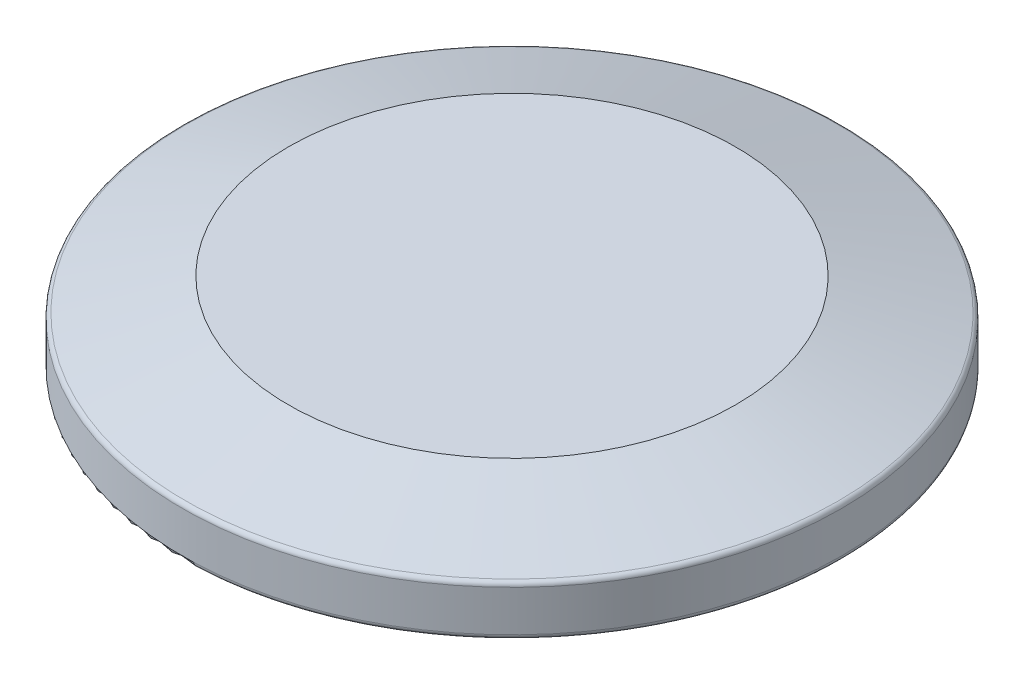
from build123d import *

# Parameters (mm, degrees)
FILLET_1_R = 0.3
FILLET_2_R = 0.3
FILLET_3_R = 0.3


with BuildPart() as part:
    # Sketch 1 → Revolve 1 (revolve)
    with BuildSketch(Plane.XY):
        Polygon((-13.2, 2.5), (-10, 2.5), (-10, 0), (0, 0), (0, 5), (-13.5, 5), (-19.9, 3), (-19.9, 0), (-13.2, 0), align=None)
    revolve(axis=Axis((0, 5, 0), (0, -1, 0)))

    # Fillet 1
    fillet_1_edges = [part.edges().sort_by_distance(p)[0] for p in [
        (19.9, 3, 0),
    ]]
    fillet(fillet_1_edges, radius=FILLET_1_R)

    # Fillet 2
    fillet_2_edges = [part.edges().sort_by_distance(p)[0] for p in [
        (19.9, 0, 0),
    ]]
    fillet(fillet_2_edges, radius=FILLET_2_R)

    # Fillet 3
    fillet_3_edges = [part.edges().sort_by_distance(p)[0] for p in [
        (13.2, 0, 0),
    ]]
    fillet(fillet_3_edges, radius=FILLET_3_R)


solid = part.part
